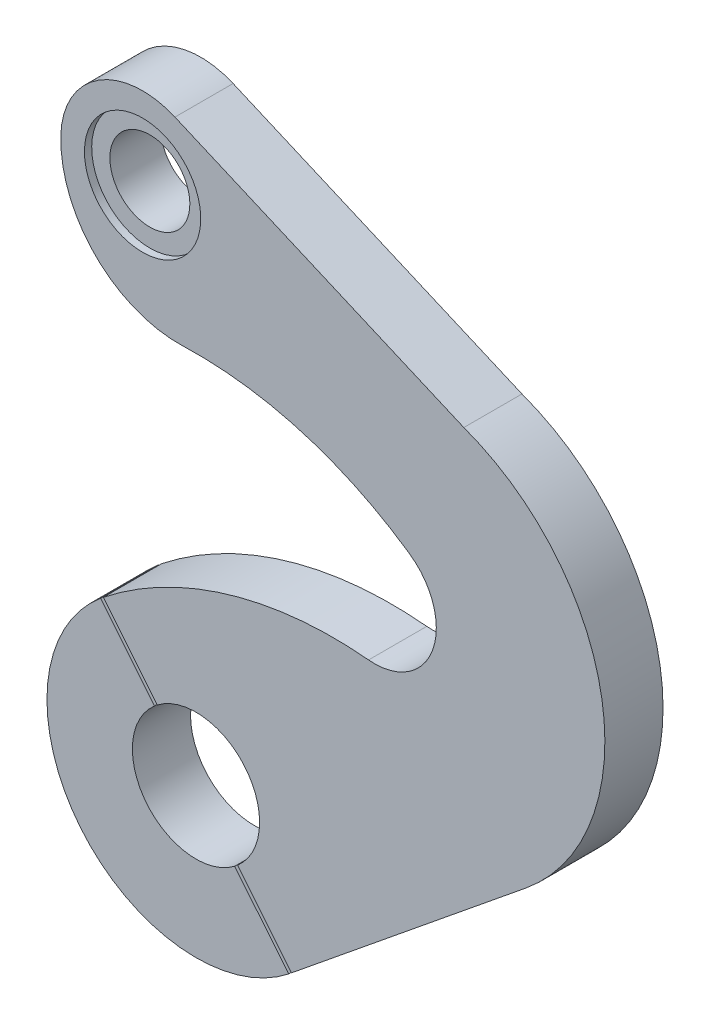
ISO-10303-21;
HEADER;
FILE_DESCRIPTION(('STEP AP214'),'2;1');
FILE_NAME('part.step','',(''),(''),'','','');
FILE_SCHEMA(('AUTOMOTIVE_DESIGN { 1 0 10303 214 1 1 1 1 }'));
ENDSEC;
DATA;
#1=APPLICATION_CONTEXT('core data for automotive mechanical design processes');
#2=APPLICATION_PROTOCOL_DEFINITION('international standard','automotive_design',2000,#1);
#3=PRODUCT_CONTEXT('',#1,'mechanical');
#4=PRODUCT('Part','Part','',(#3));
#5=PRODUCT_RELATED_PRODUCT_CATEGORY('part','',(#4));
#6=PRODUCT_DEFINITION_FORMATION('','',#4);
#7=PRODUCT_DEFINITION_CONTEXT('part definition',#1,'design');
#8=PRODUCT_DEFINITION('design','',#6,#7);
#9=PRODUCT_DEFINITION_SHAPE('','',#8);
#10=(LENGTH_UNIT() NAMED_UNIT(*) SI_UNIT(.MILLI.,.METRE.));
#11=(NAMED_UNIT(*) PLANE_ANGLE_UNIT() SI_UNIT($,.RADIAN.));
#12=(NAMED_UNIT(*) SI_UNIT($,.STERADIAN.) SOLID_ANGLE_UNIT());
#13=UNCERTAINTY_MEASURE_WITH_UNIT(LENGTH_MEASURE(1.E-05),#10,'distance_accuracy_value','');
#14=(GEOMETRIC_REPRESENTATION_CONTEXT(3) GLOBAL_UNCERTAINTY_ASSIGNED_CONTEXT((#13)) GLOBAL_UNIT_ASSIGNED_CONTEXT((#10,
#11,#12)) REPRESENTATION_CONTEXT('',''));
#15=CARTESIAN_POINT('',(0.,0.,0.));
#16=DIRECTION('',(0.,0.,1.));
#17=DIRECTION('',(1.,0.,0.));
#18=AXIS2_PLACEMENT_3D('',#15,#16,#17);
#19=CARTESIAN_POINT('',(0.,0.,-8.00000000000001));
#20=DIRECTION('',(0.,0.,1.));
#21=DIRECTION('',(-0.775765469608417,-0.631021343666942,0.));
#22=AXIS2_PLACEMENT_3D('',#19,#20,#21);
#23=CYLINDRICAL_SURFACE('',#22,17.5);
#24=DIRECTION('',(0.,0.,1.));
#25=VECTOR('',#24,1.);
#26=CARTESIAN_POINT('',(10.6504825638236,-13.8858640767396,-8.00000000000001));
#27=LINE('',#26,#25);
#28=CARTESIAN_POINT('',(10.6504825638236,-13.8858640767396,-8.00000000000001));
#29=VERTEX_POINT('',#28);
#30=CARTESIAN_POINT('',(10.6504825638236,-13.8858640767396,7.99999999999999));
#31=VERTEX_POINT('',#30);
#32=EDGE_CURVE('P0_E37',#29,#31,#27,.T.);
#33=ORIENTED_EDGE('',*,*,#32,.F.);
#34=CARTESIAN_POINT('',(0.,0.,-8.00000000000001));
#35=DIRECTION('',(0.,0.,-1.));
#36=DIRECTION('',(-0.775765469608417,-0.631021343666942,0.));
#37=AXIS2_PLACEMENT_3D('',#34,#35,#36);
#38=CIRCLE('',#37,17.5);
#39=CARTESIAN_POINT('',(-11.426248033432,13.2548427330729,-8.));
#40=VERTEX_POINT('',#39);
#41=EDGE_CURVE('P0_E70',#29,#40,#38,.T.);
#42=ORIENTED_EDGE('',*,*,#41,.T.);
#43=DIRECTION('',(0.,0.,1.));
#44=VECTOR('',#43,1.);
#45=CARTESIAN_POINT('',(-11.4262480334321,13.2548427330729,-8.));
#46=LINE('',#45,#44);
#47=CARTESIAN_POINT('',(-11.4262480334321,13.2548427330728,8.));
#48=VERTEX_POINT('',#47);
#49=EDGE_CURVE('P0_E61',#48,#40,#46,.F.);
#50=ORIENTED_EDGE('',*,*,#49,.F.);
#51=CARTESIAN_POINT('',(0.,0.,7.99999999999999));
#52=DIRECTION('',(0.,0.,-1.));
#53=DIRECTION('',(-0.775765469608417,-0.631021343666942,0.));
#54=AXIS2_PLACEMENT_3D('',#51,#52,#53);
#55=CIRCLE('',#54,17.5);
#56=EDGE_CURVE('P0_E78',#31,#48,#55,.T.);
#57=ORIENTED_EDGE('',*,*,#56,.F.);
#58=EDGE_LOOP('',(#33,#42,#50,#57));
#59=FACE_BOUND('',#58,.T.);
#60=ADVANCED_FACE('P0_F16',(#59),#23,.F.);
#61=CARTESIAN_POINT('',(0.,0.,-8.00000000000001));
#62=DIRECTION('',(0.,0.,1.));
#63=DIRECTION('',(-0.775765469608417,-0.631021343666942,0.));
#64=AXIS2_PLACEMENT_3D('',#61,#62,#63);
#65=CYLINDRICAL_SURFACE('',#64,41.);
#66=DIRECTION('',(0.,0.,1.));
#67=VECTOR('',#66,1.);
#68=CARTESIAN_POINT('',(25.4820684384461,-32.1195296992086,-8.00000000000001));
#69=LINE('',#68,#67);
#70=CARTESIAN_POINT('',(25.4820684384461,-32.1195296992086,7.99999999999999));
#71=VERTEX_POINT('',#70);
#72=CARTESIAN_POINT('',(25.4820684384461,-32.1195296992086,-8.00000000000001));
#73=VERTEX_POINT('',#72);
#74=EDGE_CURVE('P0_E53',#71,#73,#69,.F.);
#75=ORIENTED_EDGE('',*,*,#74,.F.);
#76=CARTESIAN_POINT('',(0.,0.,7.99999999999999));
#77=DIRECTION('',(0.,0.,1.));
#78=DIRECTION('',(-0.775765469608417,-0.631021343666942,0.));
#79=AXIS2_PLACEMENT_3D('',#76,#77,#78);
#80=CIRCLE('',#79,41.);
#81=CARTESIAN_POINT('',(-26.2578339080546,31.4885083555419,8.));
#82=VERTEX_POINT('',#81);
#83=EDGE_CURVE('P0_E74',#82,#71,#80,.T.);
#84=ORIENTED_EDGE('',*,*,#83,.F.);
#85=DIRECTION('',(0.,0.,1.));
#86=VECTOR('',#85,1.);
#87=CARTESIAN_POINT('',(-26.2578339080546,31.4885083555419,-8.));
#88=LINE('',#87,#86);
#89=CARTESIAN_POINT('',(-26.2578339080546,31.4885083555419,-8.));
#90=VERTEX_POINT('',#89);
#91=EDGE_CURVE('P0_E29',#90,#82,#88,.T.);
#92=ORIENTED_EDGE('',*,*,#91,.F.);
#93=CARTESIAN_POINT('',(0.,0.,-8.00000000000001));
#94=DIRECTION('',(0.,0.,1.));
#95=DIRECTION('',(-0.775765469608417,-0.631021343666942,0.));
#96=AXIS2_PLACEMENT_3D('',#93,#94,#95);
#97=CIRCLE('',#96,41.);
#98=EDGE_CURVE('P0_E68',#90,#73,#97,.T.);
#99=ORIENTED_EDGE('',*,*,#98,.T.);
#100=EDGE_LOOP('',(#75,#84,#92,#99));
#101=FACE_BOUND('',#100,.T.);
#102=ADVANCED_FACE('P0_F73',(#101),#65,.T.);
#103=CARTESIAN_POINT('',(0.,0.,-8.00000000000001));
#104=DIRECTION('',(0.,0.,1.));
#105=DIRECTION('',(-0.775765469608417,-0.631021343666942,0.));
#106=AXIS2_PLACEMENT_3D('',#103,#104,#105);
#107=PLANE('',#106);
#108=ORIENTED_EDGE('',*,*,#98,.F.);
#109=DIRECTION('',(-0.631021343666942,0.775765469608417,0.));
#110=VECTOR('',#109,1.);
#111=CARTESIAN_POINT('',(25.4839923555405,-32.1218949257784,-8.00000000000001));
#112=LINE('',#111,#110);
#113=EDGE_CURVE('P0_E71',#40,#90,#112,.T.);
#114=ORIENTED_EDGE('',*,*,#113,.F.);
#115=ORIENTED_EDGE('',*,*,#41,.F.);
#116=EDGE_CURVE('P0_E56',#73,#29,#112,.T.);
#117=ORIENTED_EDGE('',*,*,#116,.F.);
#118=EDGE_LOOP('',(#108,#114,#115,#117));
#119=FACE_BOUND('',#118,.T.);
#120=ADVANCED_FACE('P0_F66',(#119),#107,.F.);
#121=CARTESIAN_POINT('',(0.,0.,7.99999999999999));
#122=DIRECTION('',(0.,0.,1.));
#123=DIRECTION('',(-0.775765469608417,-0.631021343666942,0.));
#124=AXIS2_PLACEMENT_3D('',#121,#122,#123);
#125=PLANE('',#124);
#126=DIRECTION('',(0.631021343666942,-0.775765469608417,0.));
#127=VECTOR('',#126,1.);
#128=CARTESIAN_POINT('',(-0.387882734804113,-0.31551067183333,7.99999999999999));
#129=LINE('',#128,#127);
#130=EDGE_CURVE('P0_E11',#82,#48,#129,.T.);
#131=ORIENTED_EDGE('',*,*,#130,.F.);
#132=ORIENTED_EDGE('',*,*,#83,.T.);
#133=EDGE_CURVE('P0_E19',#31,#71,#129,.T.);
#134=ORIENTED_EDGE('',*,*,#133,.F.);
#135=ORIENTED_EDGE('',*,*,#56,.T.);
#136=EDGE_LOOP('',(#131,#132,#134,#135));
#137=FACE_BOUND('',#136,.T.);
#138=ADVANCED_FACE('P0_F88',(#137),#125,.T.);
#139=CARTESIAN_POINT('',(25.4839923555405,-32.1218949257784,7.99999999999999));
#140=DIRECTION('',(-0.775765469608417,-0.631021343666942,0.));
#141=DIRECTION('',(0.631021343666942,-0.775765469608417,0.));
#142=AXIS2_PLACEMENT_3D('',#139,#140,#141);
#143=PLANE('',#142);
#144=ORIENTED_EDGE('',*,*,#32,.T.);
#145=ORIENTED_EDGE('',*,*,#133,.T.);
#146=ORIENTED_EDGE('',*,*,#74,.T.);
#147=ORIENTED_EDGE('',*,*,#116,.T.);
#148=EDGE_LOOP('',(#144,#145,#146,#147));
#149=FACE_BOUND('',#148,.T.);
#150=ADVANCED_FACE('P0_F55',(#149),#143,.F.);
#151=ORIENTED_EDGE('',*,*,#49,.T.);
#152=ORIENTED_EDGE('',*,*,#113,.T.);
#153=ORIENTED_EDGE('',*,*,#91,.T.);
#154=ORIENTED_EDGE('',*,*,#130,.T.);
#155=EDGE_LOOP('',(#151,#152,#153,#154));
#156=FACE_BOUND('',#155,.T.);
#157=ADVANCED_FACE('P0_F83',(#156),#143,.F.);
#158=CLOSED_SHELL('',(#60,#102,#120,#138,#150,#157));
#159=MANIFOLD_SOLID_BREP('P0_B1',#158);
#160=CARTESIAN_POINT('',(49.1066817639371,70.6012309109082,-8.));
#161=DIRECTION('',(0.,0.,1.));
#162=DIRECTION('',(-0.994189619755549,-0.107642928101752,0.));
#163=AXIS2_PLACEMENT_3D('',#160,#161,#162);
#164=CYLINDRICAL_SURFACE('',#163,17.);
#165=CARTESIAN_POINT('',(49.1066817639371,70.6012309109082,-8.));
#166=DIRECTION('',(0.,0.,-1.));
#167=DIRECTION('',(0.994189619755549,0.107642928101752,0.));
#168=AXIS2_PLACEMENT_3D('',#165,#166,#167);
#169=CIRCLE('',#168,17.);
#170=CARTESIAN_POINT('',(58.8138165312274,84.5572881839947,-8.00000000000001));
#171=VERTEX_POINT('',#170);
#172=CARTESIAN_POINT('',(47.4769829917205,53.6795264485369,-8.00000000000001));
#173=VERTEX_POINT('',#172);
#174=EDGE_CURVE('P1_E109',#171,#173,#169,.T.);
#175=ORIENTED_EDGE('',*,*,#174,.T.);
#176=DIRECTION('',(0.,0.,1.));
#177=VECTOR('',#176,1.);
#178=CARTESIAN_POINT('',(47.4769829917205,53.6795264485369,-8.00000000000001));
#179=LINE('',#178,#177);
#180=CARTESIAN_POINT('',(47.4769829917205,53.6795264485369,8.));
#181=VERTEX_POINT('',#180);
#182=EDGE_CURVE('P1_E96',#173,#181,#179,.T.);
#183=ORIENTED_EDGE('',*,*,#182,.T.);
#184=CARTESIAN_POINT('',(49.1066817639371,70.6012309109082,8.));
#185=DIRECTION('',(0.,0.,1.));
#186=DIRECTION('',(-0.994189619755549,-0.107642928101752,0.));
#187=AXIS2_PLACEMENT_3D('',#184,#185,#186);
#188=CIRCLE('',#187,17.);
#189=CARTESIAN_POINT('',(58.8138165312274,84.5572881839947,7.99999999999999));
#190=VERTEX_POINT('',#189);
#191=EDGE_CURVE('P1_E24',#190,#181,#188,.F.);
#192=ORIENTED_EDGE('',*,*,#191,.F.);
#193=DIRECTION('',(0.,0.,1.));
#194=VECTOR('',#193,1.);
#195=CARTESIAN_POINT('',(58.8138165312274,84.5572881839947,-8.00000000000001));
#196=LINE('',#195,#194);
#197=EDGE_CURVE('P1_E115',#171,#190,#196,.T.);
#198=ORIENTED_EDGE('',*,*,#197,.F.);
#199=EDGE_LOOP('',(#175,#183,#192,#198));
#200=FACE_BOUND('',#199,.T.);
#201=ADVANCED_FACE('P1_F16',(#200),#164,.F.);
#202=CARTESIAN_POINT('',(-14.6932596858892,135.706883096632,-8.00000000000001));
#203=DIRECTION('',(0.,0.,1.));
#204=DIRECTION('',(-0.994189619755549,-0.107642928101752,0.));
#205=AXIS2_PLACEMENT_3D('',#202,#203,#204);
#206=PLANE('',#205);
#207=CARTESIAN_POINT('',(-14.6932596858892,135.706883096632,-8.00000000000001));
#208=DIRECTION('',(0.,0.,1.));
#209=DIRECTION('',(-0.994189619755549,-0.107642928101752,0.));
#210=AXIS2_PLACEMENT_3D('',#207,#208,#209);
#211=CIRCLE('',#210,11.);
#212=CARTESIAN_POINT('',(-25.6293455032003,134.522810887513,-8.00000000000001));
#213=VERTEX_POINT('',#212);
#214=EDGE_CURVE('P1_E175',#213,#213,#211,.T.);
#215=ORIENTED_EDGE('',*,*,#214,.T.);
#216=EDGE_LOOP('',(#215));
#217=FACE_BOUND('',#216,.T.);
#218=DIRECTION('',(-0.631021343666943,0.775765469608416,0.));
#219=VECTOR('',#218,1.);
#220=CARTESIAN_POINT('',(26.2597578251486,-31.4908735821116,-8.00000000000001));
#221=LINE('',#220,#219);
#222=CARTESIAN_POINT('',(-10.6504825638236,13.8858640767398,-8.00000000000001));
#223=VERTEX_POINT('',#222);
#224=CARTESIAN_POINT('',(-25.4820684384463,32.1195296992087,-8.00000000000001));
#225=VERTEX_POINT('',#224);
#226=EDGE_CURVE('P1_E112',#223,#225,#221,.T.);
#227=ORIENTED_EDGE('',*,*,#226,.T.);
#228=CARTESIAN_POINT('',(37.7273281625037,-47.5543828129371,-8.00000000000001));
#229=DIRECTION('',(0.,0.,-1.));
#230=DIRECTION('',(0.994189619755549,0.107642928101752,0.));
#231=AXIS2_PLACEMENT_3D('',#228,#229,#230);
#232=CIRCLE('',#231,101.702311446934);
#233=EDGE_CURVE('P1_E31',#225,#173,#232,.T.);
#234=ORIENTED_EDGE('',*,*,#233,.T.);
#235=ORIENTED_EDGE('',*,*,#174,.F.);
#236=CARTESIAN_POINT('',(0.,0.,-8.00000000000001));
#237=DIRECTION('',(0.,0.,-1.));
#238=DIRECTION('',(0.994189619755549,0.107642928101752,0.));
#239=AXIS2_PLACEMENT_3D('',#236,#237,#238);
#240=CIRCLE('',#239,103.);
#241=CARTESIAN_POINT('',(-3.565111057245,102.938282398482,-8.));
#242=VERTEX_POINT('',#241);
#243=EDGE_CURVE('P1_E120',#242,#171,#240,.T.);
#244=ORIENTED_EDGE('',*,*,#243,.F.);
#245=CARTESIAN_POINT('',(-4.69026510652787,135.425748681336,-8.));
#246=DIRECTION('',(0.,0.,1.));
#247=DIRECTION('',(-0.994189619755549,-0.107642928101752,0.));
#248=AXIS2_PLACEMENT_3D('',#245,#246,#247);
#249=CIRCLE('',#248,32.5069444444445);
#250=CARTESIAN_POINT('',(-37.1843786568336,136.338996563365,-8.00000000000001));
#251=VERTEX_POINT('',#250);
#252=EDGE_CURVE('P1_E130',#251,#242,#249,.T.);
#253=ORIENTED_EDGE('',*,*,#252,.F.);
#254=CARTESIAN_POINT('',(-14.6932596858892,135.706883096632,-8.00000000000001));
#255=DIRECTION('',(0.,0.,1.));
#256=DIRECTION('',(-0.994189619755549,-0.107642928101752,0.));
#257=AXIS2_PLACEMENT_3D('',#254,#255,#256);
#258=CIRCLE('',#257,22.5);
#259=CARTESIAN_POINT('',(-5.7927825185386,156.371623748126,-8.));
#260=VERTEX_POINT('',#259);
#261=EDGE_CURVE('P1_E178',#260,#251,#258,.T.);
#262=ORIENTED_EDGE('',*,*,#261,.F.);
#263=DIRECTION('',(0.918432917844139,-0.395576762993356,0.));
#264=VECTOR('',#263,1.);
#265=CARTESIAN_POINT('',(-5.7927825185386,156.371623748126,-8.00000000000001));
#266=LINE('',#265,#264);
#267=CARTESIAN_POINT('',(73.6755511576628,122.143945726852,-8.00000000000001));
#268=VERTEX_POINT('',#267);
#269=EDGE_CURVE('P1_E143',#260,#268,#266,.T.);
#270=ORIENTED_EDGE('',*,*,#269,.T.);
#271=CARTESIAN_POINT('',(53.4830341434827,66.7069341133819,-8.00000000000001));
#272=DIRECTION('',(0.,0.,-1.));
#273=DIRECTION('',(0.994189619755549,0.107642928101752,0.));
#274=AXIS2_PLACEMENT_3D('',#271,#272,#273);
#275=CIRCLE('',#274,59.);
#276=CARTESIAN_POINT('',(90.7132934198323,20.9367714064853,-8.));
#277=VERTEX_POINT('',#276);
#278=EDGE_CURVE('P1_E162',#268,#277,#275,.T.);
#279=ORIENTED_EDGE('',*,*,#278,.T.);
#280=DIRECTION('',(-0.775765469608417,-0.631021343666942,0.));
#281=VECTOR('',#280,1.);
#282=CARTESIAN_POINT('',(25.8718750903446,-31.8063842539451,-8.00000000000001));
#283=LINE('',#282,#281);
#284=CARTESIAN_POINT('',(26.2597578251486,-31.4908735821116,-8.00000000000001));
#285=VERTEX_POINT('',#284);
#286=EDGE_CURVE('P1_E133',#277,#285,#283,.T.);
#287=ORIENTED_EDGE('',*,*,#286,.T.);
#288=CARTESIAN_POINT('',(11.426248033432,-13.2548427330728,-8.00000000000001));
#289=VERTEX_POINT('',#288);
#290=EDGE_CURVE('P1_E39',#285,#289,#221,.T.);
#291=ORIENTED_EDGE('',*,*,#290,.T.);
#292=CARTESIAN_POINT('',(0.,0.,-8.00000000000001));
#293=DIRECTION('',(0.,0.,1.));
#294=DIRECTION('',(-0.994189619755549,-0.107642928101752,0.));
#295=AXIS2_PLACEMENT_3D('',#292,#293,#294);
#296=CIRCLE('',#295,17.5);
#297=EDGE_CURVE('P1_E173',#289,#223,#296,.T.);
#298=ORIENTED_EDGE('',*,*,#297,.T.);
#299=EDGE_LOOP('',(#227,#234,#235,#244,#253,#262,#270,#279,#287,#291,#298));
#300=FACE_BOUND('',#299,.T.);
#301=ADVANCED_FACE('P1_F108',(#217,#300),#206,.F.);
#302=CARTESIAN_POINT('',(-14.6932596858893,135.706883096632,7.99999999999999));
#303=DIRECTION('',(0.,0.,1.));
#304=DIRECTION('',(-0.994189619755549,-0.107642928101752,0.));
#305=AXIS2_PLACEMENT_3D('',#302,#303,#304);
#306=PLANE('',#305);
#307=CARTESIAN_POINT('',(37.7273281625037,-47.5543828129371,8.));
#308=DIRECTION('',(0.,0.,-1.));
#309=DIRECTION('',(0.994189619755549,0.107642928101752,0.));
#310=AXIS2_PLACEMENT_3D('',#307,#308,#309);
#311=CIRCLE('',#310,101.702311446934);
#312=CARTESIAN_POINT('',(-25.4820684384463,32.1195296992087,8.));
#313=VERTEX_POINT('',#312);
#314=EDGE_CURVE('P1_E99',#313,#181,#311,.T.);
#315=ORIENTED_EDGE('',*,*,#314,.F.);
#316=DIRECTION('',(-0.631021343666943,0.775765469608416,0.));
#317=VECTOR('',#316,1.);
#318=CARTESIAN_POINT('',(26.2597578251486,-31.4908735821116,7.99999999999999));
#319=LINE('',#318,#317);
#320=CARTESIAN_POINT('',(-10.6504825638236,13.8858640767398,8.));
#321=VERTEX_POINT('',#320);
#322=EDGE_CURVE('P1_E203',#321,#313,#319,.T.);
#323=ORIENTED_EDGE('',*,*,#322,.F.);
#324=CARTESIAN_POINT('',(0.,0.,7.99999999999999));
#325=DIRECTION('',(0.,0.,1.));
#326=DIRECTION('',(-0.994189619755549,-0.107642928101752,0.));
#327=AXIS2_PLACEMENT_3D('',#324,#325,#326);
#328=CIRCLE('',#327,17.5);
#329=CARTESIAN_POINT('',(11.426248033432,-13.2548427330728,7.99999999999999));
#330=VERTEX_POINT('',#329);
#331=EDGE_CURVE('P1_E167',#330,#321,#328,.T.);
#332=ORIENTED_EDGE('',*,*,#331,.F.);
#333=CARTESIAN_POINT('',(26.2597578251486,-31.4908735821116,7.99999999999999));
#334=VERTEX_POINT('',#333);
#335=EDGE_CURVE('P1_E201',#334,#330,#319,.T.);
#336=ORIENTED_EDGE('',*,*,#335,.F.);
#337=DIRECTION('',(-0.775765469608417,-0.631021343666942,0.));
#338=VECTOR('',#337,1.);
#339=CARTESIAN_POINT('',(25.8718750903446,-31.8063842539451,8.));
#340=LINE('',#339,#338);
#341=CARTESIAN_POINT('',(90.7132934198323,20.9367714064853,8.00000000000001));
#342=VERTEX_POINT('',#341);
#343=EDGE_CURVE('P1_E136',#342,#334,#340,.T.);
#344=ORIENTED_EDGE('',*,*,#343,.F.);
#345=CARTESIAN_POINT('',(53.4830341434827,66.7069341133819,7.99999999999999));
#346=DIRECTION('',(0.,0.,-1.));
#347=DIRECTION('',(0.994189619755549,0.107642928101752,0.));
#348=AXIS2_PLACEMENT_3D('',#345,#346,#347);
#349=CIRCLE('',#348,59.);
#350=CARTESIAN_POINT('',(73.6755511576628,122.143945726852,7.99999999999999));
#351=VERTEX_POINT('',#350);
#352=EDGE_CURVE('P1_E158',#351,#342,#349,.T.);
#353=ORIENTED_EDGE('',*,*,#352,.F.);
#354=DIRECTION('',(-0.918432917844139,0.395576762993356,0.));
#355=VECTOR('',#354,1.);
#356=CARTESIAN_POINT('',(-5.7927825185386,156.371623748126,8.));
#357=LINE('',#356,#355);
#358=CARTESIAN_POINT('',(-5.7927825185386,156.371623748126,8.));
#359=VERTEX_POINT('',#358);
#360=EDGE_CURVE('P1_E142',#351,#359,#357,.T.);
#361=ORIENTED_EDGE('',*,*,#360,.T.);
#362=CARTESIAN_POINT('',(-14.6932596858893,135.706883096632,7.99999999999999));
#363=DIRECTION('',(0.,0.,1.));
#364=DIRECTION('',(-0.994189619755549,-0.107642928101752,0.));
#365=AXIS2_PLACEMENT_3D('',#362,#363,#364);
#366=CIRCLE('',#365,22.5);
#367=CARTESIAN_POINT('',(-37.1843786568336,136.338996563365,8.));
#368=VERTEX_POINT('',#367);
#369=EDGE_CURVE('P1_E170',#359,#368,#366,.T.);
#370=ORIENTED_EDGE('',*,*,#369,.T.);
#371=CARTESIAN_POINT('',(-4.69026510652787,135.425748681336,8.));
#372=DIRECTION('',(0.,0.,1.));
#373=DIRECTION('',(-0.994189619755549,-0.107642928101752,0.));
#374=AXIS2_PLACEMENT_3D('',#371,#372,#373);
#375=CIRCLE('',#374,32.5069444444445);
#376=CARTESIAN_POINT('',(-3.565111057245,102.938282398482,8.));
#377=VERTEX_POINT('',#376);
#378=EDGE_CURVE('P1_E127',#368,#377,#375,.T.);
#379=ORIENTED_EDGE('',*,*,#378,.T.);
#380=CARTESIAN_POINT('',(0.,0.,7.99999999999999));
#381=DIRECTION('',(0.,0.,1.));
#382=DIRECTION('',(-0.994189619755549,-0.107642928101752,0.));
#383=AXIS2_PLACEMENT_3D('',#380,#381,#382);
#384=CIRCLE('',#383,103.);
#385=EDGE_CURVE('P1_E11',#377,#190,#384,.F.);
#386=ORIENTED_EDGE('',*,*,#385,.T.);
#387=ORIENTED_EDGE('',*,*,#191,.T.);
#388=EDGE_LOOP('',(#315,#323,#332,#336,#344,#353,#361,#370,#379,#386,#387));
#389=FACE_BOUND('',#388,.T.);
#390=CARTESIAN_POINT('',(-14.6932596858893,135.706883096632,7.99999999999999));
#391=DIRECTION('',(0.,0.,1.));
#392=DIRECTION('',(-0.994189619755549,-0.107642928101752,0.));
#393=AXIS2_PLACEMENT_3D('',#390,#391,#392);
#394=CIRCLE('',#393,16.);
#395=CARTESIAN_POINT('',(-30.6002936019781,133.984596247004,7.99999999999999));
#396=VERTEX_POINT('',#395);
#397=EDGE_CURVE('P1_E146',#396,#396,#394,.T.);
#398=ORIENTED_EDGE('',*,*,#397,.F.);
#399=EDGE_LOOP('',(#398));
#400=FACE_BOUND('',#399,.T.);
#401=ADVANCED_FACE('P1_F183',(#389,#400),#306,.T.);
#402=CARTESIAN_POINT('',(0.,0.,-8.00000000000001));
#403=DIRECTION('',(0.,0.,1.));
#404=DIRECTION('',(-0.994189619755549,-0.107642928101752,0.));
#405=AXIS2_PLACEMENT_3D('',#402,#403,#404);
#406=CYLINDRICAL_SURFACE('',#405,17.5);
#407=ORIENTED_EDGE('',*,*,#331,.T.);
#408=DIRECTION('',(0.,0.,1.));
#409=VECTOR('',#408,1.);
#410=CARTESIAN_POINT('',(-10.6504825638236,13.8858640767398,-8.));
#411=LINE('',#410,#409);
#412=EDGE_CURVE('P1_E122',#321,#223,#411,.F.);
#413=ORIENTED_EDGE('',*,*,#412,.T.);
#414=ORIENTED_EDGE('',*,*,#297,.F.);
#415=DIRECTION('',(0.,0.,1.));
#416=VECTOR('',#415,1.);
#417=CARTESIAN_POINT('',(11.426248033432,-13.2548427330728,-8.00000000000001));
#418=LINE('',#417,#416);
#419=EDGE_CURVE('P1_E196',#289,#330,#418,.T.);
#420=ORIENTED_EDGE('',*,*,#419,.T.);
#421=EDGE_LOOP('',(#407,#413,#414,#420));
#422=FACE_BOUND('',#421,.T.);
#423=ADVANCED_FACE('P1_F211',(#422),#406,.F.);
#424=CARTESIAN_POINT('',(-14.6932596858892,135.706883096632,-8.00000000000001));
#425=DIRECTION('',(0.,0.,1.));
#426=DIRECTION('',(-0.994189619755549,-0.107642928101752,0.));
#427=AXIS2_PLACEMENT_3D('',#424,#425,#426);
#428=CYLINDRICAL_SURFACE('',#427,22.5);
#429=DIRECTION('',(0.,0.,-1.));
#430=VECTOR('',#429,1.);
#431=CARTESIAN_POINT('',(-37.1843786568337,136.338996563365,190.208643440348));
#432=LINE('',#431,#430);
#433=EDGE_CURVE('P1_E129',#368,#251,#432,.T.);
#434=ORIENTED_EDGE('',*,*,#433,.F.);
#435=ORIENTED_EDGE('',*,*,#369,.F.);
#436=DIRECTION('',(0.,0.,1.));
#437=VECTOR('',#436,1.);
#438=CARTESIAN_POINT('',(-5.7927825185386,156.371623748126,-94.5260076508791));
#439=LINE('',#438,#437);
#440=EDGE_CURVE('P1_E147',#260,#359,#439,.T.);
#441=ORIENTED_EDGE('',*,*,#440,.F.);
#442=ORIENTED_EDGE('',*,*,#261,.T.);
#443=EDGE_LOOP('',(#434,#435,#441,#442));
#444=FACE_BOUND('',#443,.T.);
#445=ADVANCED_FACE('P1_F18',(#444),#428,.T.);
#446=CARTESIAN_POINT('',(-14.6932596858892,135.706883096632,-8.00000000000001));
#447=DIRECTION('',(0.,0.,1.));
#448=DIRECTION('',(-0.994189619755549,-0.107642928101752,0.));
#449=AXIS2_PLACEMENT_3D('',#446,#447,#448);
#450=CYLINDRICAL_SURFACE('',#449,11.);
#451=ORIENTED_EDGE('',*,*,#214,.F.);
#452=EDGE_LOOP('',(#451));
#453=FACE_BOUND('',#452,.T.);
#454=CARTESIAN_POINT('',(-14.6932596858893,135.706883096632,6.));
#455=DIRECTION('',(0.,0.,1.));
#456=DIRECTION('',(-0.994189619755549,-0.107642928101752,0.));
#457=AXIS2_PLACEMENT_3D('',#454,#455,#456);
#458=CIRCLE('',#457,11.);
#459=CARTESIAN_POINT('',(-25.6293455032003,134.522810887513,6.));
#460=VERTEX_POINT('',#459);
#461=EDGE_CURVE('P1_E155',#460,#460,#458,.F.);
#462=ORIENTED_EDGE('',*,*,#461,.F.);
#463=EDGE_LOOP('',(#462));
#464=FACE_BOUND('',#463,.T.);
#465=ADVANCED_FACE('P1_F314',(#453,#464),#450,.F.);
#466=CARTESIAN_POINT('',(53.4830341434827,66.7069341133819,7.99999999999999));
#467=DIRECTION('',(0.,0.,-1.));
#468=DIRECTION('',(0.994189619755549,0.107642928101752,0.));
#469=AXIS2_PLACEMENT_3D('',#466,#467,#468);
#470=CYLINDRICAL_SURFACE('',#469,59.);
#471=DIRECTION('',(0.,0.,-1.));
#472=VECTOR('',#471,1.);
#473=CARTESIAN_POINT('',(90.7132934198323,20.9367714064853,91.5837902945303));
#474=LINE('',#473,#472);
#475=EDGE_CURVE('P1_E139',#342,#277,#474,.T.);
#476=ORIENTED_EDGE('',*,*,#475,.T.);
#477=ORIENTED_EDGE('',*,*,#278,.F.);
#478=DIRECTION('',(0.,0.,-1.));
#479=VECTOR('',#478,1.);
#480=CARTESIAN_POINT('',(73.6755511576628,122.143945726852,7.99999999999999));
#481=LINE('',#480,#479);
#482=EDGE_CURVE('P1_E161',#351,#268,#481,.T.);
#483=ORIENTED_EDGE('',*,*,#482,.F.);
#484=ORIENTED_EDGE('',*,*,#352,.T.);
#485=EDGE_LOOP('',(#476,#477,#483,#484));
#486=FACE_BOUND('',#485,.T.);
#487=ADVANCED_FACE('P1_F218',(#486),#470,.T.);
#488=CARTESIAN_POINT('',(-14.6932596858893,135.706883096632,6.));
#489=DIRECTION('',(0.,0.,1.));
#490=DIRECTION('',(-0.994189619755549,-0.107642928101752,0.));
#491=AXIS2_PLACEMENT_3D('',#488,#489,#490);
#492=PLANE('',#491);
#493=CARTESIAN_POINT('',(-14.6932596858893,135.706883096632,6.));
#494=DIRECTION('',(0.,0.,1.));
#495=DIRECTION('',(-0.994189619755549,-0.107642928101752,0.));
#496=AXIS2_PLACEMENT_3D('',#493,#494,#495);
#497=CIRCLE('',#496,16.);
#498=CARTESIAN_POINT('',(-30.6002936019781,133.984596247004,6.));
#499=VERTEX_POINT('',#498);
#500=EDGE_CURVE('P1_E152',#499,#499,#497,.T.);
#501=ORIENTED_EDGE('',*,*,#500,.T.);
#502=EDGE_LOOP('',(#501));
#503=FACE_BOUND('',#502,.T.);
#504=ORIENTED_EDGE('',*,*,#461,.T.);
#505=EDGE_LOOP('',(#504));
#506=FACE_BOUND('',#505,.T.);
#507=ADVANCED_FACE('P1_F295',(#503,#506),#492,.T.);
#508=CARTESIAN_POINT('',(-14.6932596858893,135.706883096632,6.));
#509=DIRECTION('',(0.,0.,1.));
#510=DIRECTION('',(-0.994189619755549,-0.107642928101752,0.));
#511=AXIS2_PLACEMENT_3D('',#508,#509,#510);
#512=CYLINDRICAL_SURFACE('',#511,16.);
#513=ORIENTED_EDGE('',*,*,#500,.F.);
#514=EDGE_LOOP('',(#513));
#515=FACE_BOUND('',#514,.T.);
#516=ORIENTED_EDGE('',*,*,#397,.T.);
#517=EDGE_LOOP('',(#516));
#518=FACE_BOUND('',#517,.T.);
#519=ADVANCED_FACE('P1_F286',(#515,#518),#512,.F.);
#520=CARTESIAN_POINT('',(-5.7927825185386,156.371623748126,-94.5260076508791));
#521=DIRECTION('',(0.395576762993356,0.918432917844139,0.));
#522=DIRECTION('',(-0.918432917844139,0.395576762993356,0.));
#523=AXIS2_PLACEMENT_3D('',#520,#521,#522);
#524=PLANE('',#523);
#525=ORIENTED_EDGE('',*,*,#269,.F.);
#526=ORIENTED_EDGE('',*,*,#440,.T.);
#527=ORIENTED_EDGE('',*,*,#360,.F.);
#528=ORIENTED_EDGE('',*,*,#482,.T.);
#529=EDGE_LOOP('',(#525,#526,#527,#528));
#530=FACE_BOUND('',#529,.T.);
#531=ADVANCED_FACE('P1_F223',(#530),#524,.T.);
#532=CARTESIAN_POINT('',(25.8718750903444,-31.8063842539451,91.5837902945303));
#533=DIRECTION('',(0.631021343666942,-0.775765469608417,0.));
#534=DIRECTION('',(0.775765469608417,0.631021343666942,0.));
#535=AXIS2_PLACEMENT_3D('',#532,#533,#534);
#536=PLANE('',#535);
#537=DIRECTION('',(0.,0.,1.));
#538=VECTOR('',#537,1.);
#539=CARTESIAN_POINT('',(26.2597578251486,-31.4908735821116,-8.00000000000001));
#540=LINE('',#539,#538);
#541=EDGE_CURVE('P1_E199',#285,#334,#540,.T.);
#542=ORIENTED_EDGE('',*,*,#541,.F.);
#543=ORIENTED_EDGE('',*,*,#286,.F.);
#544=ORIENTED_EDGE('',*,*,#475,.F.);
#545=ORIENTED_EDGE('',*,*,#343,.T.);
#546=EDGE_LOOP('',(#542,#543,#544,#545));
#547=FACE_BOUND('',#546,.T.);
#548=ADVANCED_FACE('P1_F216',(#547),#536,.T.);
#549=CARTESIAN_POINT('',(-4.69026510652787,135.425748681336,-8.));
#550=DIRECTION('',(0.,0.,1.));
#551=DIRECTION('',(-0.994189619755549,-0.107642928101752,0.));
#552=AXIS2_PLACEMENT_3D('',#549,#550,#551);
#553=CYLINDRICAL_SURFACE('',#552,32.5069444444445);
#554=ORIENTED_EDGE('',*,*,#378,.F.);
#555=ORIENTED_EDGE('',*,*,#433,.T.);
#556=ORIENTED_EDGE('',*,*,#252,.T.);
#557=DIRECTION('',(0.,0.,1.));
#558=VECTOR('',#557,1.);
#559=CARTESIAN_POINT('',(-3.565111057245,102.938282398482,-8.));
#560=LINE('',#559,#558);
#561=EDGE_CURVE('P1_E117',#242,#377,#560,.T.);
#562=ORIENTED_EDGE('',*,*,#561,.T.);
#563=EDGE_LOOP('',(#554,#555,#556,#562));
#564=FACE_BOUND('',#563,.T.);
#565=ADVANCED_FACE('P1_F227',(#564),#553,.T.);
#566=CARTESIAN_POINT('',(0.,0.,-8.00000000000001));
#567=DIRECTION('',(0.,0.,1.));
#568=DIRECTION('',(-0.994189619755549,-0.107642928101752,0.));
#569=AXIS2_PLACEMENT_3D('',#566,#567,#568);
#570=CYLINDRICAL_SURFACE('',#569,103.);
#571=ORIENTED_EDGE('',*,*,#385,.F.);
#572=ORIENTED_EDGE('',*,*,#561,.F.);
#573=ORIENTED_EDGE('',*,*,#243,.T.);
#574=ORIENTED_EDGE('',*,*,#197,.T.);
#575=EDGE_LOOP('',(#571,#572,#573,#574));
#576=FACE_BOUND('',#575,.T.);
#577=ADVANCED_FACE('P1_F189',(#576),#570,.F.);
#578=CARTESIAN_POINT('',(26.2597578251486,-31.4908735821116,-8.00000000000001));
#579=DIRECTION('',(0.775765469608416,0.631021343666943,0.));
#580=DIRECTION('',(-0.631021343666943,0.775765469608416,0.));
#581=AXIS2_PLACEMENT_3D('',#578,#579,#580);
#582=PLANE('',#581);
#583=ORIENTED_EDGE('',*,*,#290,.F.);
#584=ORIENTED_EDGE('',*,*,#541,.T.);
#585=ORIENTED_EDGE('',*,*,#335,.T.);
#586=ORIENTED_EDGE('',*,*,#419,.F.);
#587=EDGE_LOOP('',(#583,#584,#585,#586));
#588=FACE_BOUND('',#587,.T.);
#589=ADVANCED_FACE('P1_F213',(#588),#582,.F.);
#590=ORIENTED_EDGE('',*,*,#322,.T.);
#591=DIRECTION('',(0.,0.,1.));
#592=VECTOR('',#591,1.);
#593=CARTESIAN_POINT('',(-25.4820684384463,32.1195296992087,-8.00000000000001));
#594=LINE('',#593,#592);
#595=EDGE_CURVE('P1_E104',#225,#313,#594,.T.);
#596=ORIENTED_EDGE('',*,*,#595,.F.);
#597=ORIENTED_EDGE('',*,*,#226,.F.);
#598=ORIENTED_EDGE('',*,*,#412,.F.);
#599=EDGE_LOOP('',(#590,#596,#597,#598));
#600=FACE_BOUND('',#599,.T.);
#601=ADVANCED_FACE('P1_F207',(#600),#582,.F.);
#602=CARTESIAN_POINT('',(37.7273281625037,-47.5543828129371,-8.00000000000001));
#603=DIRECTION('',(0.,0.,1.));
#604=DIRECTION('',(-0.994189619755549,-0.107642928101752,0.));
#605=AXIS2_PLACEMENT_3D('',#602,#603,#604);
#606=CYLINDRICAL_SURFACE('',#605,101.702311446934);
#607=ORIENTED_EDGE('',*,*,#314,.T.);
#608=ORIENTED_EDGE('',*,*,#182,.F.);
#609=ORIENTED_EDGE('',*,*,#233,.F.);
#610=ORIENTED_EDGE('',*,*,#595,.T.);
#611=EDGE_LOOP('',(#607,#608,#609,#610));
#612=FACE_BOUND('',#611,.T.);
#613=ADVANCED_FACE('P1_F97',(#612),#606,.T.);
#614=CLOSED_SHELL('',(#201,#301,#401,#423,#445,#465,#487,#507,#519,#531,#548,#565,#577,#589,
#601,#613));
#615=MANIFOLD_SOLID_BREP('P1_B1',#614);
#616=ADVANCED_BREP_SHAPE_REPRESENTATION('',(#18,#159,#615),#14);
#617=SHAPE_DEFINITION_REPRESENTATION(#9,#616);
ENDSEC;
END-ISO-10303-21;
